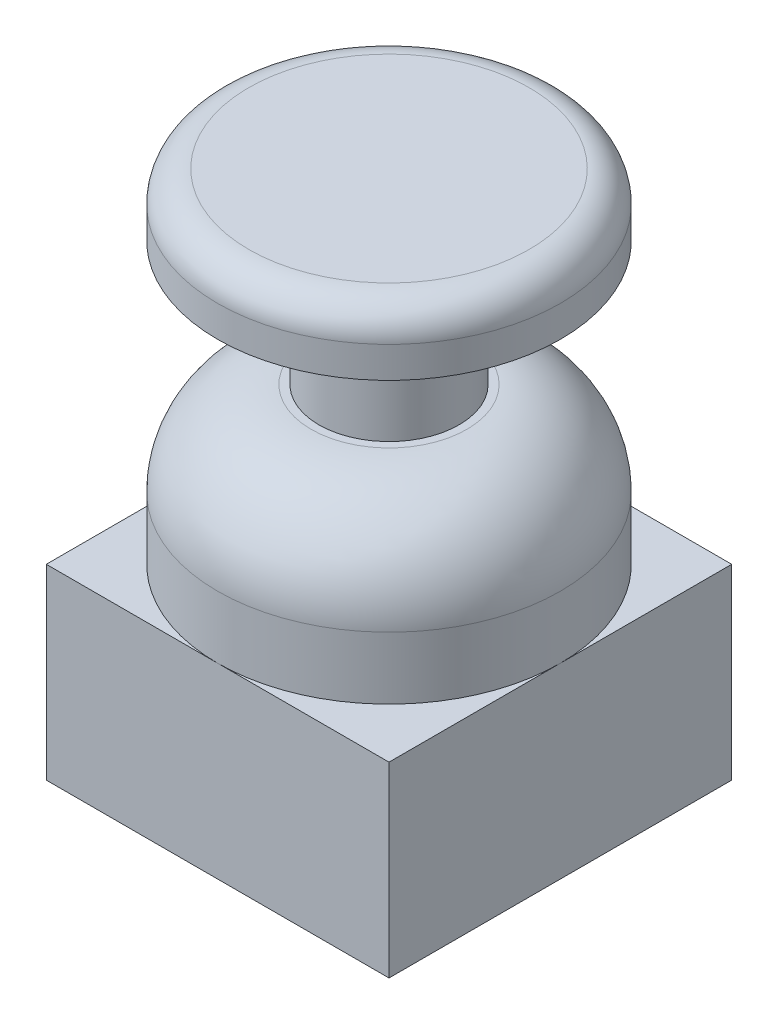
from build123d import *

# Parameters (mm, degrees)
SKETCH2_W         = 22
SKETCH2_H         = 22
SWITCH_BASE_DEPTH = 12


with BuildPart() as part:
    # Sketch1 → Stick Revolve (revolve)
    with BuildSketch(Plane.XY, mode=Mode.PRIVATE) as stick_revolve_sk:
        with BuildLine():
            Line((0, 0), (-11, 0))
            Line((-11, 0), (-11, 16))
            ThreePointArc((-11, 16), (-9.242640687, 20.242640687), (-5, 22))
            Line((-5, 22), (-4.5, 22))
            Line((-4.5, 22), (-4.5, 30))
            Line((-4.5, 30), (-11, 30))
            Line((-11, 30), (-11, 32))
            ThreePointArc((-11, 32), (-10.414213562, 33.414213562), (-9, 34))
            Line((-9, 34), (0, 34))
            Line((0, 34), (0, 0))
        make_face()
    revolve(stick_revolve_sk.sketch.rotate(Axis((0, 34, 0), (0, -1, 0)), 270), axis=Axis((0, 34, 0), (0, -1, 0)))

    # Sketch2 → Switch Base (add)
    with BuildSketch(Plane.XZ):
        Rectangle(SKETCH2_W, SKETCH2_H)
    extrude(amount=-SWITCH_BASE_DEPTH)


solid = part.part
